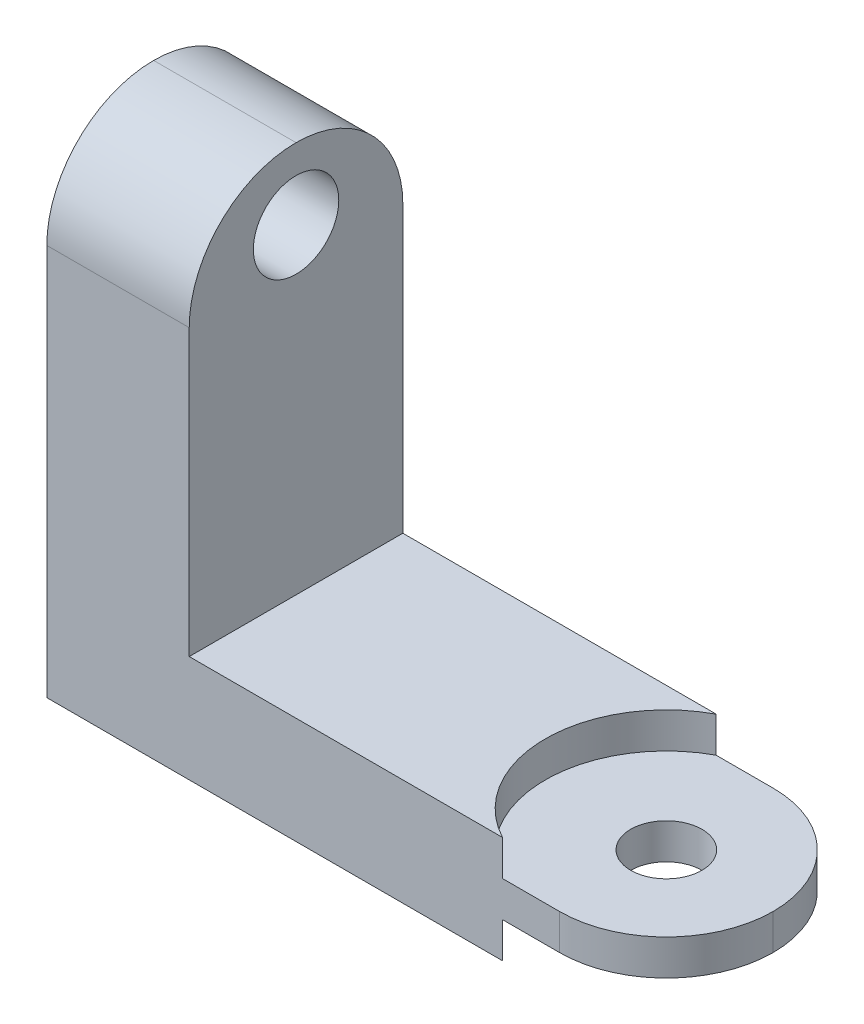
ISO-10303-21;
HEADER;
FILE_DESCRIPTION(('STEP AP214'),'2;1');
FILE_NAME('part.step','',(''),(''),'','','');
FILE_SCHEMA(('AUTOMOTIVE_DESIGN { 1 0 10303 214 1 1 1 1 }'));
ENDSEC;
DATA;
#1=APPLICATION_CONTEXT('core data for automotive mechanical design processes');
#2=APPLICATION_PROTOCOL_DEFINITION('international standard','automotive_design',2000,#1);
#3=PRODUCT_CONTEXT('',#1,'mechanical');
#4=PRODUCT('Part','Part','',(#3));
#5=PRODUCT_RELATED_PRODUCT_CATEGORY('part','',(#4));
#6=PRODUCT_DEFINITION_FORMATION('','',#4);
#7=PRODUCT_DEFINITION_CONTEXT('part definition',#1,'design');
#8=PRODUCT_DEFINITION('design','',#6,#7);
#9=PRODUCT_DEFINITION_SHAPE('','',#8);
#10=(LENGTH_UNIT() NAMED_UNIT(*) SI_UNIT(.MILLI.,.METRE.));
#11=(NAMED_UNIT(*) PLANE_ANGLE_UNIT() SI_UNIT($,.RADIAN.));
#12=(NAMED_UNIT(*) SI_UNIT($,.STERADIAN.) SOLID_ANGLE_UNIT());
#13=UNCERTAINTY_MEASURE_WITH_UNIT(LENGTH_MEASURE(1.E-05),#10,'distance_accuracy_value','');
#14=(GEOMETRIC_REPRESENTATION_CONTEXT(3) GLOBAL_UNCERTAINTY_ASSIGNED_CONTEXT((#13)) GLOBAL_UNIT_ASSIGNED_CONTEXT((#10,
#11,#12)) REPRESENTATION_CONTEXT('',''));
#15=CARTESIAN_POINT('',(0.,0.,0.));
#16=DIRECTION('',(0.,0.,1.));
#17=DIRECTION('',(1.,0.,0.));
#18=AXIS2_PLACEMENT_3D('',#15,#16,#17);
#19=CARTESIAN_POINT('',(72.,0.,15.));
#20=DIRECTION('',(0.,1.,0.));
#21=DIRECTION('',(0.,0.,1.));
#22=AXIS2_PLACEMENT_3D('',#19,#20,#21);
#23=CYLINDRICAL_SURFACE('',#22,15.);
#24=DIRECTION('',(0.,1.,0.));
#25=VECTOR('',#24,1.);
#26=CARTESIAN_POINT('',(87.,0.,15.));
#27=LINE('',#26,#25);
#28=CARTESIAN_POINT('',(87.,5.,15.));
#29=VERTEX_POINT('',#28);
#30=CARTESIAN_POINT('',(87.,10.,15.));
#31=VERTEX_POINT('',#30);
#32=EDGE_CURVE('E229',#29,#31,#27,.T.);
#33=ORIENTED_EDGE('',*,*,#32,.F.);
#34=CARTESIAN_POINT('',(72.,5.,15.));
#35=DIRECTION('',(0.,-1.,0.));
#36=DIRECTION('',(0.,0.,-1.));
#37=AXIS2_PLACEMENT_3D('',#34,#35,#36);
#38=CIRCLE('',#37,15.);
#39=CARTESIAN_POINT('',(72.,5.,0.));
#40=VERTEX_POINT('',#39);
#41=EDGE_CURVE('E198',#29,#40,#38,.F.);
#42=ORIENTED_EDGE('',*,*,#41,.T.);
#43=DIRECTION('',(0.,1.,0.));
#44=VECTOR('',#43,1.);
#45=CARTESIAN_POINT('',(72.,0.,0.));
#46=LINE('',#45,#44);
#47=CARTESIAN_POINT('',(72.,10.,0.));
#48=VERTEX_POINT('',#47);
#49=EDGE_CURVE('E160',#48,#40,#46,.F.);
#50=ORIENTED_EDGE('',*,*,#49,.F.);
#51=CARTESIAN_POINT('',(72.,10.,15.));
#52=DIRECTION('',(0.,1.,0.));
#53=DIRECTION('',(-1.,0.,0.));
#54=AXIS2_PLACEMENT_3D('',#51,#52,#53);
#55=CIRCLE('',#54,15.);
#56=EDGE_CURVE('E213',#48,#31,#55,.F.);
#57=ORIENTED_EDGE('',*,*,#56,.T.);
#58=EDGE_LOOP('',(#33,#42,#50,#57));
#59=FACE_BOUND('',#58,.T.);
#60=ADVANCED_FACE('F26',(#59),#23,.T.);
#61=CARTESIAN_POINT('',(72.,0.,15.));
#62=DIRECTION('',(0.,-1.,0.));
#63=DIRECTION('',(0.,0.,-1.));
#64=AXIS2_PLACEMENT_3D('',#61,#62,#63);
#65=CYLINDRICAL_SURFACE('',#64,15.);
#66=DIRECTION('',(0.,1.,0.));
#67=VECTOR('',#66,1.);
#68=CARTESIAN_POINT('',(72.,15.,30.));
#69=LINE('',#68,#67);
#70=CARTESIAN_POINT('',(72.,5.,30.));
#71=VERTEX_POINT('',#70);
#72=CARTESIAN_POINT('',(72.,10.,30.));
#73=VERTEX_POINT('',#72);
#74=EDGE_CURVE('E158',#71,#73,#69,.T.);
#75=ORIENTED_EDGE('',*,*,#74,.F.);
#76=CARTESIAN_POINT('',(72.,5.,15.));
#77=DIRECTION('',(0.,-1.,0.));
#78=DIRECTION('',(0.,0.,-1.));
#79=AXIS2_PLACEMENT_3D('',#76,#77,#78);
#80=CIRCLE('',#79,15.);
#81=EDGE_CURVE('E201',#71,#29,#80,.F.);
#82=ORIENTED_EDGE('',*,*,#81,.T.);
#83=ORIENTED_EDGE('',*,*,#32,.T.);
#84=CARTESIAN_POINT('',(72.,10.,15.));
#85=DIRECTION('',(0.,1.,0.));
#86=DIRECTION('',(-1.,0.,0.));
#87=AXIS2_PLACEMENT_3D('',#84,#85,#86);
#88=CIRCLE('',#87,15.);
#89=EDGE_CURVE('E167',#31,#73,#88,.F.);
#90=ORIENTED_EDGE('',*,*,#89,.T.);
#91=EDGE_LOOP('',(#75,#82,#83,#90));
#92=FACE_BOUND('',#91,.T.);
#93=ADVANCED_FACE('F251',(#92),#65,.T.);
#94=CARTESIAN_POINT('',(72.,0.,15.));
#95=DIRECTION('',(0.,1.,0.));
#96=DIRECTION('',(-1.,0.,0.));
#97=AXIS2_PLACEMENT_3D('',#94,#95,#96);
#98=CYLINDRICAL_SURFACE('',#97,5.);
#99=CARTESIAN_POINT('',(72.,10.,15.));
#100=DIRECTION('',(0.,1.,0.));
#101=DIRECTION('',(-1.,0.,0.));
#102=AXIS2_PLACEMENT_3D('',#99,#100,#101);
#103=CIRCLE('',#102,5.);
#104=CARTESIAN_POINT('',(67.,10.,15.));
#105=VERTEX_POINT('',#104);
#106=EDGE_CURVE('E164',#105,#105,#103,.F.);
#107=CARTESIAN_POINT('',(72.,5.,15.));
#108=DIRECTION('',(0.,-1.,0.));
#109=DIRECTION('',(0.,0.,-1.));
#110=AXIS2_PLACEMENT_3D('',#107,#108,#109);
#111=CIRCLE('',#110,5.);
#112=CARTESIAN_POINT('',(67.,5.,15.));
#113=VERTEX_POINT('',#112);
#114=EDGE_CURVE('E126',#113,#113,#111,.F.);
#115=CARTESIAN_POINT('',(67.,10.,15.));
#116=CARTESIAN_POINT('',(67.,9.94791666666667,15.));
#117=CARTESIAN_POINT('',(67.,9.89583333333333,15.));
#118=CARTESIAN_POINT('',(67.,9.79166666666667,15.));
#119=CARTESIAN_POINT('',(67.,9.73958333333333,15.));
#120=CARTESIAN_POINT('',(67.,9.63541666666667,15.));
#121=CARTESIAN_POINT('',(67.,9.58333333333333,15.));
#122=CARTESIAN_POINT('',(67.,9.47916666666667,15.));
#123=CARTESIAN_POINT('',(67.,9.42708333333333,15.));
#124=CARTESIAN_POINT('',(67.,9.32291666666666,15.));
#125=CARTESIAN_POINT('',(67.,9.27083333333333,15.));
#126=CARTESIAN_POINT('',(67.,9.16666666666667,15.));
#127=CARTESIAN_POINT('',(67.,9.11458333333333,15.));
#128=CARTESIAN_POINT('',(67.,9.01041666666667,15.));
#129=CARTESIAN_POINT('',(67.,8.95833333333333,15.));
#130=CARTESIAN_POINT('',(67.,8.85416666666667,15.));
#131=CARTESIAN_POINT('',(67.,8.80208333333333,15.));
#132=CARTESIAN_POINT('',(67.,8.69791666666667,15.));
#133=CARTESIAN_POINT('',(67.,8.64583333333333,15.));
#134=CARTESIAN_POINT('',(67.,8.54166666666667,15.));
#135=CARTESIAN_POINT('',(67.,8.48958333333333,15.));
#136=CARTESIAN_POINT('',(67.,8.38541666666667,15.));
#137=CARTESIAN_POINT('',(67.,8.33333333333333,15.));
#138=CARTESIAN_POINT('',(67.,8.22916666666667,15.));
#139=CARTESIAN_POINT('',(67.,8.17708333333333,15.));
#140=CARTESIAN_POINT('',(67.,8.07291666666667,15.));
#141=CARTESIAN_POINT('',(67.,8.02083333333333,15.));
#142=CARTESIAN_POINT('',(67.,7.91666666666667,15.));
#143=CARTESIAN_POINT('',(67.,7.86458333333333,15.));
#144=CARTESIAN_POINT('',(67.,7.76041666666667,15.));
#145=CARTESIAN_POINT('',(67.,7.70833333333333,15.));
#146=CARTESIAN_POINT('',(67.,7.60416666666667,15.));
#147=CARTESIAN_POINT('',(67.,7.55208333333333,15.));
#148=CARTESIAN_POINT('',(67.,7.44791666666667,15.));
#149=CARTESIAN_POINT('',(67.,7.39583333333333,15.));
#150=CARTESIAN_POINT('',(67.,7.29166666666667,15.));
#151=CARTESIAN_POINT('',(67.,7.23958333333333,15.));
#152=CARTESIAN_POINT('',(67.,7.13541666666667,15.));
#153=CARTESIAN_POINT('',(67.,7.08333333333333,15.));
#154=CARTESIAN_POINT('',(67.,6.97916666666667,15.));
#155=CARTESIAN_POINT('',(67.,6.92708333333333,15.));
#156=CARTESIAN_POINT('',(67.,6.82291666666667,15.));
#157=CARTESIAN_POINT('',(67.,6.77083333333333,15.));
#158=CARTESIAN_POINT('',(67.,6.66666666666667,15.));
#159=CARTESIAN_POINT('',(67.,6.61458333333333,15.));
#160=CARTESIAN_POINT('',(67.,6.51041666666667,15.));
#161=CARTESIAN_POINT('',(67.,6.45833333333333,15.));
#162=CARTESIAN_POINT('',(67.,6.35416666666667,15.));
#163=CARTESIAN_POINT('',(67.,6.30208333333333,15.));
#164=CARTESIAN_POINT('',(67.,6.19791666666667,15.));
#165=CARTESIAN_POINT('',(67.,6.14583333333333,15.));
#166=CARTESIAN_POINT('',(67.,6.04166666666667,15.));
#167=CARTESIAN_POINT('',(67.,5.98958333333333,15.));
#168=CARTESIAN_POINT('',(67.,5.88541666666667,15.));
#169=CARTESIAN_POINT('',(67.,5.83333333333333,15.));
#170=CARTESIAN_POINT('',(67.,5.72916666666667,15.));
#171=CARTESIAN_POINT('',(67.,5.67708333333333,15.));
#172=CARTESIAN_POINT('',(67.,5.57291666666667,15.));
#173=CARTESIAN_POINT('',(67.,5.52083333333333,15.));
#174=CARTESIAN_POINT('',(67.,5.41666666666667,15.));
#175=CARTESIAN_POINT('',(67.,5.36458333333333,15.));
#176=CARTESIAN_POINT('',(67.,5.26041666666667,15.));
#177=CARTESIAN_POINT('',(67.,5.20833333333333,15.));
#178=CARTESIAN_POINT('',(67.,5.10416666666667,15.));
#179=CARTESIAN_POINT('',(67.,5.05208333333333,15.));
#180=CARTESIAN_POINT('',(67.,5.,15.));
#181=B_SPLINE_CURVE_WITH_KNOTS('',3,(#115,#116,#117,#118,#119,#120,#121,#122,#123,#124,#125,
#126,#127,#128,#129,#130,#131,#132,#133,#134,#135,#136,#137,#138,#139,#140,#141,#142,#143,#144,
#145,#146,#147,#148,#149,#150,#151,#152,#153,#154,#155,#156,#157,#158,#159,#160,#161,#162,#163,
#164,#165,#166,#167,#168,#169,#170,#171,#172,#173,#174,#175,#176,#177,#178,#179,#180),
.UNSPECIFIED.,.F.,.F.,(4,2,2,2,2,2,2,2,2,2,2,2,2,2,2,2,2,2,2,2,2,2,2,2,2,2,2,2,2,2,2,2,4),(0.,
0.15625,0.3125,0.46875,0.625000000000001,0.781249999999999,0.937499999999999,1.09375,1.25,
1.40625,1.5625,1.71875,1.875,2.03125,2.1875,2.34375,2.5,2.65625,2.8125,2.96875,3.125,3.28125,
3.4375,3.59375,3.75,3.90625,4.0625,4.21875,4.375,4.53125,4.6875,4.84375,5.),.UNSPECIFIED.);
#182=EDGE_CURVE('BSEAM263',#105,#113,#181,.T.);
#183=ORIENTED_EDGE('',*,*,#106,.F.);
#184=ORIENTED_EDGE('',*,*,#114,.F.);
#185=ORIENTED_EDGE('',*,*,#182,.T.);
#186=ORIENTED_EDGE('',*,*,#182,.F.);
#187=EDGE_LOOP('',(#183,#185,#184,#186));
#188=FACE_BOUND('',#187,.T.);
#189=ADVANCED_FACE('F263',(#188),#98,.F.);
#190=CARTESIAN_POINT('',(0.,70.,30.));
#191=DIRECTION('',(1.,0.,0.));
#192=DIRECTION('',(0.,1.,0.));
#193=AXIS2_PLACEMENT_3D('',#190,#191,#192);
#194=PLANE('',#193);
#195=CARTESIAN_POINT('',(0.,60.,15.));
#196=DIRECTION('',(1.,0.,0.));
#197=DIRECTION('',(0.,0.,-1.));
#198=AXIS2_PLACEMENT_3D('',#195,#196,#197);
#199=CIRCLE('',#198,6.);
#200=CARTESIAN_POINT('',(0.,60.,9.00000000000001));
#201=VERTEX_POINT('',#200);
#202=EDGE_CURVE('E226',#201,#201,#199,.T.);
#203=ORIENTED_EDGE('',*,*,#202,.T.);
#204=EDGE_LOOP('',(#203));
#205=FACE_BOUND('',#204,.T.);
#206=DIRECTION('',(0.,-1.,0.));
#207=VECTOR('',#206,1.);
#208=CARTESIAN_POINT('',(0.,70.,30.));
#209=LINE('',#208,#207);
#210=CARTESIAN_POINT('',(0.,55.,30.));
#211=VERTEX_POINT('',#210);
#212=CARTESIAN_POINT('',(0.,0.,30.));
#213=VERTEX_POINT('',#212);
#214=EDGE_CURVE('E143',#211,#213,#209,.T.);
#215=ORIENTED_EDGE('',*,*,#214,.F.);
#216=CARTESIAN_POINT('',(0.,55.,15.));
#217=DIRECTION('',(1.,0.,0.));
#218=DIRECTION('',(0.,1.,0.));
#219=AXIS2_PLACEMENT_3D('',#216,#217,#218);
#220=CIRCLE('',#219,15.);
#221=CARTESIAN_POINT('',(0.,70.,15.));
#222=VERTEX_POINT('',#221);
#223=EDGE_CURVE('E179',#211,#222,#220,.F.);
#224=ORIENTED_EDGE('',*,*,#223,.T.);
#225=CARTESIAN_POINT('',(0.,55.,15.));
#226=DIRECTION('',(1.,0.,0.));
#227=DIRECTION('',(0.,1.,0.));
#228=AXIS2_PLACEMENT_3D('',#225,#226,#227);
#229=CIRCLE('',#228,15.);
#230=CARTESIAN_POINT('',(0.,55.,0.));
#231=VERTEX_POINT('',#230);
#232=EDGE_CURVE('E177',#222,#231,#229,.F.);
#233=ORIENTED_EDGE('',*,*,#232,.T.);
#234=DIRECTION('',(0.,-1.,0.));
#235=VECTOR('',#234,1.);
#236=CARTESIAN_POINT('',(0.,70.,0.));
#237=LINE('',#236,#235);
#238=CARTESIAN_POINT('',(0.,0.,0.));
#239=VERTEX_POINT('',#238);
#240=EDGE_CURVE('E231',#231,#239,#237,.T.);
#241=ORIENTED_EDGE('',*,*,#240,.T.);
#242=DIRECTION('',(0.,0.,-1.));
#243=VECTOR('',#242,1.);
#244=CARTESIAN_POINT('',(0.,0.,30.));
#245=LINE('',#244,#243);
#246=EDGE_CURVE('E156',#213,#239,#245,.T.);
#247=ORIENTED_EDGE('',*,*,#246,.F.);
#248=EDGE_LOOP('',(#215,#224,#233,#241,#247));
#249=FACE_BOUND('',#248,.T.);
#250=ADVANCED_FACE('F28',(#205,#249),#194,.F.);
#251=CARTESIAN_POINT('',(0.,0.,30.));
#252=DIRECTION('',(0.,1.,0.));
#253=DIRECTION('',(0.,0.,1.));
#254=AXIS2_PLACEMENT_3D('',#251,#252,#253);
#255=PLANE('',#254);
#256=DIRECTION('',(1.,0.,0.));
#257=VECTOR('',#256,1.);
#258=CARTESIAN_POINT('',(0.,0.,0.));
#259=LINE('',#258,#257);
#260=CARTESIAN_POINT('',(64.,0.,0.));
#261=VERTEX_POINT('',#260);
#262=EDGE_CURVE('E136',#239,#261,#259,.T.);
#263=ORIENTED_EDGE('',*,*,#262,.T.);
#264=CARTESIAN_POINT('',(72.,0.,15.));
#265=DIRECTION('',(0.,-1.,0.));
#266=DIRECTION('',(0.,0.,-1.));
#267=AXIS2_PLACEMENT_3D('',#264,#265,#266);
#268=CIRCLE('',#267,17.);
#269=CARTESIAN_POINT('',(64.,0.,30.));
#270=VERTEX_POINT('',#269);
#271=EDGE_CURVE('E119',#270,#261,#268,.T.);
#272=ORIENTED_EDGE('',*,*,#271,.F.);
#273=DIRECTION('',(1.,0.,0.));
#274=VECTOR('',#273,1.);
#275=CARTESIAN_POINT('',(0.,0.,30.));
#276=LINE('',#275,#274);
#277=EDGE_CURVE('E133',#213,#270,#276,.T.);
#278=ORIENTED_EDGE('',*,*,#277,.F.);
#279=ORIENTED_EDGE('',*,*,#246,.T.);
#280=EDGE_LOOP('',(#263,#272,#278,#279));
#281=FACE_BOUND('',#280,.T.);
#282=ADVANCED_FACE('F131',(#281),#255,.F.);
#283=CARTESIAN_POINT('',(87.,15.,30.));
#284=DIRECTION('',(0.,-1.,0.));
#285=DIRECTION('',(1.,0.,0.));
#286=AXIS2_PLACEMENT_3D('',#283,#284,#285);
#287=PLANE('',#286);
#288=DIRECTION('',(-1.,0.,0.));
#289=VECTOR('',#288,1.);
#290=CARTESIAN_POINT('',(87.,15.,30.));
#291=LINE('',#290,#289);
#292=CARTESIAN_POINT('',(64.,15.,30.));
#293=VERTEX_POINT('',#292);
#294=CARTESIAN_POINT('',(20.,15.,30.));
#295=VERTEX_POINT('',#294);
#296=EDGE_CURVE('E144',#293,#295,#291,.T.);
#297=ORIENTED_EDGE('',*,*,#296,.F.);
#298=CARTESIAN_POINT('',(72.,15.,15.));
#299=DIRECTION('',(0.,1.,0.));
#300=DIRECTION('',(-1.,0.,0.));
#301=AXIS2_PLACEMENT_3D('',#298,#299,#300);
#302=CIRCLE('',#301,17.);
#303=CARTESIAN_POINT('',(64.,15.,0.));
#304=VERTEX_POINT('',#303);
#305=EDGE_CURVE('E125',#304,#293,#302,.T.);
#306=ORIENTED_EDGE('',*,*,#305,.F.);
#307=DIRECTION('',(-1.,0.,0.));
#308=VECTOR('',#307,1.);
#309=CARTESIAN_POINT('',(87.,15.,0.));
#310=LINE('',#309,#308);
#311=CARTESIAN_POINT('',(20.,15.,0.));
#312=VERTEX_POINT('',#311);
#313=EDGE_CURVE('E234',#304,#312,#310,.T.);
#314=ORIENTED_EDGE('',*,*,#313,.T.);
#315=DIRECTION('',(0.,0.,-1.));
#316=VECTOR('',#315,1.);
#317=CARTESIAN_POINT('',(20.,15.,30.));
#318=LINE('',#317,#316);
#319=EDGE_CURVE('E153',#295,#312,#318,.T.);
#320=ORIENTED_EDGE('',*,*,#319,.F.);
#321=EDGE_LOOP('',(#297,#306,#314,#320));
#322=FACE_BOUND('',#321,.T.);
#323=ADVANCED_FACE('F240',(#322),#287,.F.);
#324=CARTESIAN_POINT('',(20.,15.,30.));
#325=DIRECTION('',(-1.,0.,0.));
#326=DIRECTION('',(0.,0.,1.));
#327=AXIS2_PLACEMENT_3D('',#324,#325,#326);
#328=PLANE('',#327);
#329=CARTESIAN_POINT('',(20.,60.,15.));
#330=DIRECTION('',(1.,0.,0.));
#331=DIRECTION('',(0.,0.,-1.));
#332=AXIS2_PLACEMENT_3D('',#329,#330,#331);
#333=CIRCLE('',#332,6.);
#334=CARTESIAN_POINT('',(20.,60.,9.00000000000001));
#335=VERTEX_POINT('',#334);
#336=EDGE_CURVE('E223',#335,#335,#333,.T.);
#337=ORIENTED_EDGE('',*,*,#336,.F.);
#338=EDGE_LOOP('',(#337));
#339=FACE_BOUND('',#338,.T.);
#340=CARTESIAN_POINT('',(20.,55.,15.));
#341=DIRECTION('',(-1.,0.,0.));
#342=DIRECTION('',(0.,0.,1.));
#343=AXIS2_PLACEMENT_3D('',#340,#341,#342);
#344=CIRCLE('',#343,15.);
#345=CARTESIAN_POINT('',(20.,55.,0.));
#346=VERTEX_POINT('',#345);
#347=CARTESIAN_POINT('',(20.,70.,15.));
#348=VERTEX_POINT('',#347);
#349=EDGE_CURVE('E41',#346,#348,#344,.F.);
#350=ORIENTED_EDGE('',*,*,#349,.T.);
#351=CARTESIAN_POINT('',(20.,55.,15.));
#352=DIRECTION('',(-1.,0.,0.));
#353=DIRECTION('',(0.,0.,1.));
#354=AXIS2_PLACEMENT_3D('',#351,#352,#353);
#355=CIRCLE('',#354,15.);
#356=CARTESIAN_POINT('',(20.,55.,30.));
#357=VERTEX_POINT('',#356);
#358=EDGE_CURVE('E34',#348,#357,#355,.F.);
#359=ORIENTED_EDGE('',*,*,#358,.T.);
#360=DIRECTION('',(0.,1.,0.));
#361=VECTOR('',#360,1.);
#362=CARTESIAN_POINT('',(20.,15.,30.));
#363=LINE('',#362,#361);
#364=EDGE_CURVE('E146',#295,#357,#363,.T.);
#365=ORIENTED_EDGE('',*,*,#364,.F.);
#366=ORIENTED_EDGE('',*,*,#319,.T.);
#367=DIRECTION('',(0.,1.,0.));
#368=VECTOR('',#367,1.);
#369=CARTESIAN_POINT('',(20.,15.,0.));
#370=LINE('',#369,#368);
#371=EDGE_CURVE('E148',#312,#346,#370,.T.);
#372=ORIENTED_EDGE('',*,*,#371,.T.);
#373=EDGE_LOOP('',(#350,#359,#365,#366,#372));
#374=FACE_BOUND('',#373,.T.);
#375=ADVANCED_FACE('F183',(#339,#374),#328,.F.);
#376=CARTESIAN_POINT('',(0.,0.,30.));
#377=DIRECTION('',(0.,0.,1.));
#378=DIRECTION('',(1.,0.,0.));
#379=AXIS2_PLACEMENT_3D('',#376,#377,#378);
#380=PLANE('',#379);
#381=ORIENTED_EDGE('',*,*,#364,.T.);
#382=DIRECTION('',(-1.,0.,0.));
#383=VECTOR('',#382,1.);
#384=CARTESIAN_POINT('',(0.,55.,30.));
#385=LINE('',#384,#383);
#386=EDGE_CURVE('E175',#357,#211,#385,.T.);
#387=ORIENTED_EDGE('',*,*,#386,.T.);
#388=ORIENTED_EDGE('',*,*,#214,.T.);
#389=ORIENTED_EDGE('',*,*,#277,.T.);
#390=DIRECTION('',(0.,-1.,0.));
#391=VECTOR('',#390,1.);
#392=CARTESIAN_POINT('',(64.,5.,30.));
#393=LINE('',#392,#391);
#394=CARTESIAN_POINT('',(64.,5.,30.));
#395=VERTEX_POINT('',#394);
#396=EDGE_CURVE('E115',#395,#270,#393,.T.);
#397=ORIENTED_EDGE('',*,*,#396,.F.);
#398=DIRECTION('',(1.,0.,0.));
#399=VECTOR('',#398,1.);
#400=CARTESIAN_POINT('',(0.,5.,30.));
#401=LINE('',#400,#399);
#402=EDGE_CURVE('E204',#395,#71,#401,.T.);
#403=ORIENTED_EDGE('',*,*,#402,.T.);
#404=ORIENTED_EDGE('',*,*,#74,.T.);
#405=DIRECTION('',(-1.,0.,0.));
#406=VECTOR('',#405,1.);
#407=CARTESIAN_POINT('',(0.,9.99999999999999,30.));
#408=LINE('',#407,#406);
#409=CARTESIAN_POINT('',(64.,10.,30.));
#410=VERTEX_POINT('',#409);
#411=EDGE_CURVE('E218',#73,#410,#408,.T.);
#412=ORIENTED_EDGE('',*,*,#411,.T.);
#413=DIRECTION('',(0.,1.,0.));
#414=VECTOR('',#413,1.);
#415=CARTESIAN_POINT('',(64.,10.,30.));
#416=LINE('',#415,#414);
#417=EDGE_CURVE('E221',#293,#410,#416,.F.);
#418=ORIENTED_EDGE('',*,*,#417,.F.);
#419=ORIENTED_EDGE('',*,*,#296,.T.);
#420=EDGE_LOOP('',(#381,#387,#388,#389,#397,#403,#404,#412,#418,#419));
#421=FACE_BOUND('',#420,.T.);
#422=ADVANCED_FACE('F140',(#421),#380,.T.);
#423=CARTESIAN_POINT('',(0.,0.,0.));
#424=DIRECTION('',(0.,0.,1.));
#425=DIRECTION('',(1.,0.,0.));
#426=AXIS2_PLACEMENT_3D('',#423,#424,#425);
#427=PLANE('',#426);
#428=ORIENTED_EDGE('',*,*,#240,.F.);
#429=DIRECTION('',(-1.,0.,0.));
#430=VECTOR('',#429,1.);
#431=CARTESIAN_POINT('',(0.,55.,0.));
#432=LINE('',#431,#430);
#433=EDGE_CURVE('E11',#231,#346,#432,.F.);
#434=ORIENTED_EDGE('',*,*,#433,.T.);
#435=ORIENTED_EDGE('',*,*,#371,.F.);
#436=ORIENTED_EDGE('',*,*,#313,.F.);
#437=DIRECTION('',(0.,1.,0.));
#438=VECTOR('',#437,1.);
#439=CARTESIAN_POINT('',(64.,10.,0.));
#440=LINE('',#439,#438);
#441=CARTESIAN_POINT('',(64.,10.,0.));
#442=VERTEX_POINT('',#441);
#443=EDGE_CURVE('E163',#304,#442,#440,.F.);
#444=ORIENTED_EDGE('',*,*,#443,.T.);
#445=DIRECTION('',(-1.,0.,0.));
#446=VECTOR('',#445,1.);
#447=CARTESIAN_POINT('',(0.,9.99999999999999,0.));
#448=LINE('',#447,#446);
#449=EDGE_CURVE('E216',#48,#442,#448,.T.);
#450=ORIENTED_EDGE('',*,*,#449,.F.);
#451=ORIENTED_EDGE('',*,*,#49,.T.);
#452=DIRECTION('',(1.,0.,0.));
#453=VECTOR('',#452,1.);
#454=CARTESIAN_POINT('',(0.,5.,0.));
#455=LINE('',#454,#453);
#456=CARTESIAN_POINT('',(64.,5.,0.));
#457=VERTEX_POINT('',#456);
#458=EDGE_CURVE('E171',#457,#40,#455,.T.);
#459=ORIENTED_EDGE('',*,*,#458,.F.);
#460=DIRECTION('',(0.,-1.,0.));
#461=VECTOR('',#460,1.);
#462=CARTESIAN_POINT('',(64.,5.,0.));
#463=LINE('',#462,#461);
#464=EDGE_CURVE('E173',#457,#261,#463,.T.);
#465=ORIENTED_EDGE('',*,*,#464,.T.);
#466=ORIENTED_EDGE('',*,*,#262,.F.);
#467=EDGE_LOOP('',(#428,#434,#435,#436,#444,#450,#451,#459,#465,#466));
#468=FACE_BOUND('',#467,.T.);
#469=ADVANCED_FACE('F236',(#468),#427,.F.);
#470=CARTESIAN_POINT('',(0.,60.,15.));
#471=DIRECTION('',(1.,0.,0.));
#472=DIRECTION('',(0.,0.,-1.));
#473=AXIS2_PLACEMENT_3D('',#470,#471,#472);
#474=CYLINDRICAL_SURFACE('',#473,6.);
#475=ORIENTED_EDGE('',*,*,#202,.F.);
#476=EDGE_LOOP('',(#475));
#477=FACE_BOUND('',#476,.T.);
#478=ORIENTED_EDGE('',*,*,#336,.T.);
#479=EDGE_LOOP('',(#478));
#480=FACE_BOUND('',#479,.T.);
#481=ADVANCED_FACE('F285',(#477,#480),#474,.F.);
#482=CARTESIAN_POINT('',(72.,10.,15.));
#483=DIRECTION('',(0.,1.,0.));
#484=DIRECTION('',(-1.,0.,0.));
#485=AXIS2_PLACEMENT_3D('',#482,#483,#484);
#486=PLANE('',#485);
#487=ORIENTED_EDGE('',*,*,#89,.F.);
#488=ORIENTED_EDGE('',*,*,#56,.F.);
#489=ORIENTED_EDGE('',*,*,#449,.T.);
#490=CARTESIAN_POINT('',(72.,10.,15.));
#491=DIRECTION('',(0.,1.,0.));
#492=DIRECTION('',(-1.,0.,0.));
#493=AXIS2_PLACEMENT_3D('',#490,#491,#492);
#494=CIRCLE('',#493,17.);
#495=EDGE_CURVE('E168',#442,#410,#494,.T.);
#496=ORIENTED_EDGE('',*,*,#495,.T.);
#497=ORIENTED_EDGE('',*,*,#411,.F.);
#498=EDGE_LOOP('',(#487,#488,#489,#496,#497));
#499=FACE_BOUND('',#498,.T.);
#500=ORIENTED_EDGE('',*,*,#106,.T.);
#501=EDGE_LOOP('',(#500));
#502=FACE_BOUND('',#501,.T.);
#503=ADVANCED_FACE('F248',(#499,#502),#486,.T.);
#504=CARTESIAN_POINT('',(72.,10.,15.));
#505=DIRECTION('',(0.,1.,0.));
#506=DIRECTION('',(-1.,0.,0.));
#507=AXIS2_PLACEMENT_3D('',#504,#505,#506);
#508=CYLINDRICAL_SURFACE('',#507,17.);
#509=ORIENTED_EDGE('',*,*,#417,.T.);
#510=ORIENTED_EDGE('',*,*,#495,.F.);
#511=ORIENTED_EDGE('',*,*,#443,.F.);
#512=ORIENTED_EDGE('',*,*,#305,.T.);
#513=EDGE_LOOP('',(#509,#510,#511,#512));
#514=FACE_BOUND('',#513,.T.);
#515=ADVANCED_FACE('F242',(#514),#508,.F.);
#516=CARTESIAN_POINT('',(72.,5.,15.));
#517=DIRECTION('',(0.,-1.,0.));
#518=DIRECTION('',(0.,0.,-1.));
#519=AXIS2_PLACEMENT_3D('',#516,#517,#518);
#520=PLANE('',#519);
#521=CARTESIAN_POINT('',(72.,5.,15.));
#522=DIRECTION('',(0.,-1.,0.));
#523=DIRECTION('',(0.,0.,-1.));
#524=AXIS2_PLACEMENT_3D('',#521,#522,#523);
#525=CIRCLE('',#524,17.);
#526=EDGE_CURVE('E121',#395,#457,#525,.T.);
#527=ORIENTED_EDGE('',*,*,#526,.T.);
#528=ORIENTED_EDGE('',*,*,#458,.T.);
#529=ORIENTED_EDGE('',*,*,#41,.F.);
#530=ORIENTED_EDGE('',*,*,#81,.F.);
#531=ORIENTED_EDGE('',*,*,#402,.F.);
#532=EDGE_LOOP('',(#527,#528,#529,#530,#531));
#533=FACE_BOUND('',#532,.T.);
#534=ORIENTED_EDGE('',*,*,#114,.T.);
#535=EDGE_LOOP('',(#534));
#536=FACE_BOUND('',#535,.T.);
#537=ADVANCED_FACE('F257',(#533,#536),#520,.T.);
#538=CARTESIAN_POINT('',(72.,5.,15.));
#539=DIRECTION('',(0.,-1.,0.));
#540=DIRECTION('',(0.,0.,-1.));
#541=AXIS2_PLACEMENT_3D('',#538,#539,#540);
#542=CYLINDRICAL_SURFACE('',#541,17.);
#543=ORIENTED_EDGE('',*,*,#396,.T.);
#544=ORIENTED_EDGE('',*,*,#271,.T.);
#545=ORIENTED_EDGE('',*,*,#464,.F.);
#546=ORIENTED_EDGE('',*,*,#526,.F.);
#547=EDGE_LOOP('',(#543,#544,#545,#546));
#548=FACE_BOUND('',#547,.T.);
#549=ADVANCED_FACE('F117',(#548),#542,.F.);
#550=CARTESIAN_POINT('',(20.,55.,15.));
#551=DIRECTION('',(-1.,0.,0.));
#552=DIRECTION('',(0.,0.,1.));
#553=AXIS2_PLACEMENT_3D('',#550,#551,#552);
#554=CYLINDRICAL_SURFACE('',#553,15.);
#555=DIRECTION('',(-1.,0.,0.));
#556=VECTOR('',#555,1.);
#557=CARTESIAN_POINT('',(20.,70.,15.));
#558=LINE('',#557,#556);
#559=EDGE_CURVE('E137',#348,#222,#558,.T.);
#560=ORIENTED_EDGE('',*,*,#559,.F.);
#561=ORIENTED_EDGE('',*,*,#349,.F.);
#562=ORIENTED_EDGE('',*,*,#433,.F.);
#563=ORIENTED_EDGE('',*,*,#232,.F.);
#564=EDGE_LOOP('',(#560,#561,#562,#563));
#565=FACE_BOUND('',#564,.T.);
#566=ADVANCED_FACE('F194',(#565),#554,.T.);
#567=CARTESIAN_POINT('',(0.,55.,15.));
#568=DIRECTION('',(1.,0.,0.));
#569=DIRECTION('',(0.,0.,-1.));
#570=AXIS2_PLACEMENT_3D('',#567,#568,#569);
#571=CYLINDRICAL_SURFACE('',#570,15.);
#572=ORIENTED_EDGE('',*,*,#358,.F.);
#573=ORIENTED_EDGE('',*,*,#559,.T.);
#574=ORIENTED_EDGE('',*,*,#223,.F.);
#575=ORIENTED_EDGE('',*,*,#386,.F.);
#576=EDGE_LOOP('',(#572,#573,#574,#575));
#577=FACE_BOUND('',#576,.T.);
#578=ADVANCED_FACE('F190',(#577),#571,.T.);
#579=CLOSED_SHELL('',(#60,#93,#189,#250,#282,#323,#375,#422,#469,#481,#503,#515,#537,#549,#566,#578));
#580=MANIFOLD_SOLID_BREP('B2',#579);
#581=ADVANCED_BREP_SHAPE_REPRESENTATION('',(#18,#580),#14);
#582=SHAPE_DEFINITION_REPRESENTATION(#9,#581);
ENDSEC;
END-ISO-10303-21;
